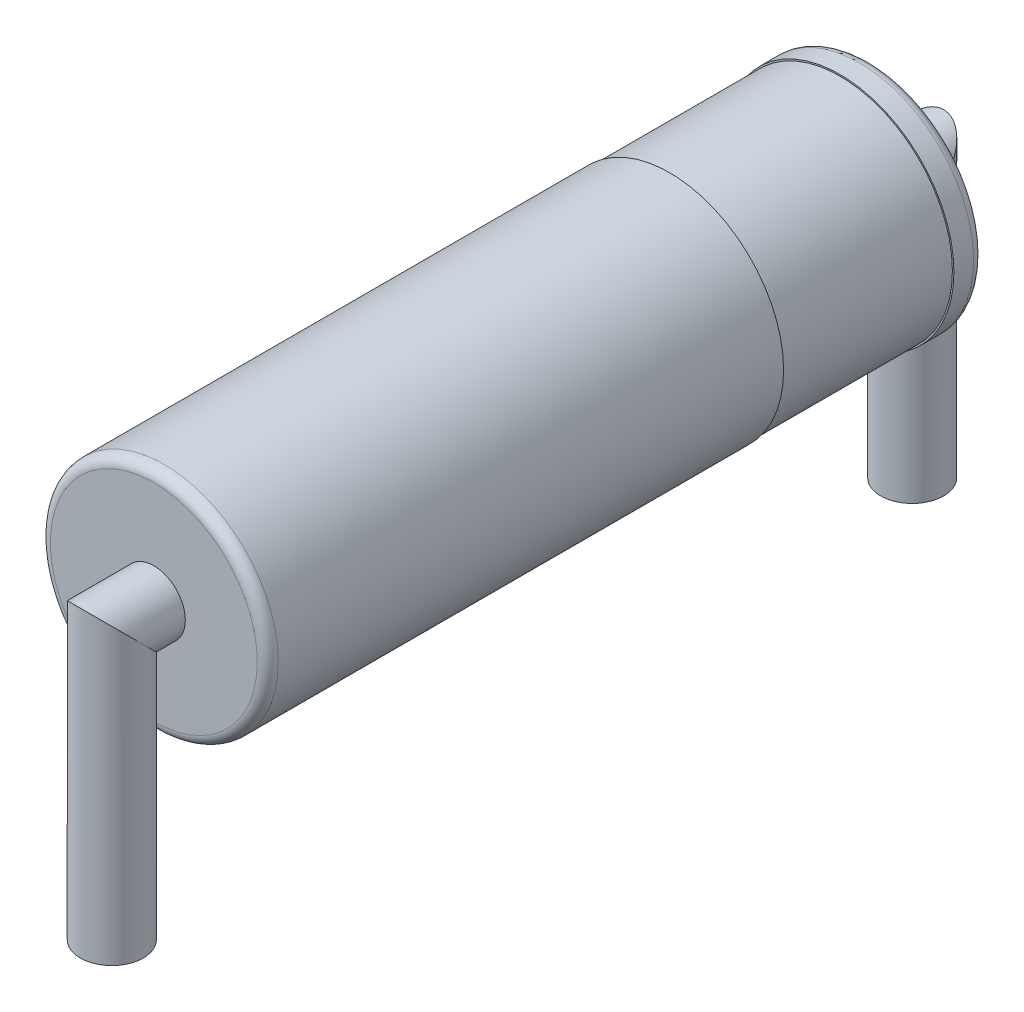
ISO-10303-21;
HEADER;
FILE_DESCRIPTION(('STEP AP214'),'2;1');
FILE_NAME('part.step','',(''),(''),'','','');
FILE_SCHEMA(('AUTOMOTIVE_DESIGN { 1 0 10303 214 1 1 1 1 }'));
ENDSEC;
DATA;
#1=APPLICATION_CONTEXT('core data for automotive mechanical design processes');
#2=APPLICATION_PROTOCOL_DEFINITION('international standard','automotive_design',2000,#1);
#3=PRODUCT_CONTEXT('',#1,'mechanical');
#4=PRODUCT('Part','Part','',(#3));
#5=PRODUCT_RELATED_PRODUCT_CATEGORY('part','',(#4));
#6=PRODUCT_DEFINITION_FORMATION('','',#4);
#7=PRODUCT_DEFINITION_CONTEXT('part definition',#1,'design');
#8=PRODUCT_DEFINITION('design','',#6,#7);
#9=PRODUCT_DEFINITION_SHAPE('','',#8);
#10=(LENGTH_UNIT() NAMED_UNIT(*) SI_UNIT(.MILLI.,.METRE.));
#11=(NAMED_UNIT(*) PLANE_ANGLE_UNIT() SI_UNIT($,.RADIAN.));
#12=(NAMED_UNIT(*) SI_UNIT($,.STERADIAN.) SOLID_ANGLE_UNIT());
#13=UNCERTAINTY_MEASURE_WITH_UNIT(LENGTH_MEASURE(1.E-05),#10,'distance_accuracy_value','');
#14=(GEOMETRIC_REPRESENTATION_CONTEXT(3) GLOBAL_UNCERTAINTY_ASSIGNED_CONTEXT((#13)) GLOBAL_UNIT_ASSIGNED_CONTEXT((#10,
#11,#12)) REPRESENTATION_CONTEXT('',''));
#15=CARTESIAN_POINT('',(0.,0.,0.));
#16=DIRECTION('',(0.,0.,1.));
#17=DIRECTION('',(1.,0.,0.));
#18=AXIS2_PLACEMENT_3D('',#15,#16,#17);
#19=CARTESIAN_POINT('',(0.,0.,3.41));
#20=DIRECTION('',(0.,0.,-1.));
#21=DIRECTION('',(-1.,0.,0.));
#22=AXIS2_PLACEMENT_3D('',#19,#20,#21);
#23=CYLINDRICAL_SURFACE('',#22,1.085);
#24=CARTESIAN_POINT('',(0.,0.,-3.31));
#25=DIRECTION('',(0.,0.,1.));
#26=DIRECTION('',(1.,0.,0.));
#27=AXIS2_PLACEMENT_3D('',#24,#25,#26);
#28=CIRCLE('',#27,1.085);
#29=CARTESIAN_POINT('',(1.085,0.,-3.31));
#30=VERTEX_POINT('',#29);
#31=EDGE_CURVE('E76',#30,#30,#28,.T.);
#32=ORIENTED_EDGE('',*,*,#31,.T.);
#33=EDGE_LOOP('',(#32));
#34=FACE_BOUND('',#33,.T.);
#35=CARTESIAN_POINT('',(0.,0.,-3.12192987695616));
#36=DIRECTION('',(0.,0.,1.));
#37=DIRECTION('',(1.,0.,0.));
#38=AXIS2_PLACEMENT_3D('',#35,#36,#37);
#39=CIRCLE('',#38,1.085);
#40=CARTESIAN_POINT('',(1.085,0.,-3.12192987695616));
#41=VERTEX_POINT('',#40);
#42=EDGE_CURVE('E35',#41,#41,#39,.T.);
#43=ORIENTED_EDGE('',*,*,#42,.F.);
#44=EDGE_LOOP('',(#43));
#45=FACE_BOUND('',#44,.T.);
#46=ADVANCED_FACE('F32',(#34,#45),#23,.T.);
#47=CARTESIAN_POINT('',(0.,0.,-3.41));
#48=DIRECTION('',(0.,0.,1.));
#49=DIRECTION('',(1.,0.,0.));
#50=AXIS2_PLACEMENT_3D('',#47,#48,#49);
#51=PLANE('',#50);
#52=CARTESIAN_POINT('',(0.,0.,-3.41));
#53=DIRECTION('',(0.,0.,1.));
#54=DIRECTION('',(1.,0.,0.));
#55=AXIS2_PLACEMENT_3D('',#52,#53,#54);
#56=CIRCLE('',#55,0.985);
#57=CARTESIAN_POINT('',(0.985,0.,-3.41));
#58=VERTEX_POINT('',#57);
#59=EDGE_CURVE('E44',#58,#58,#56,.F.);
#60=ORIENTED_EDGE('',*,*,#59,.T.);
#61=EDGE_LOOP('',(#60));
#62=FACE_BOUND('',#61,.T.);
#63=CARTESIAN_POINT('',(0.,0.,-3.41));
#64=DIRECTION('',(0.,0.,1.));
#65=DIRECTION('',(1.,0.,0.));
#66=AXIS2_PLACEMENT_3D('',#63,#64,#65);
#67=CIRCLE('',#66,0.3);
#68=CARTESIAN_POINT('',(0.3,0.,-3.41));
#69=VERTEX_POINT('',#68);
#70=EDGE_CURVE('E39',#69,#69,#67,.F.);
#71=ORIENTED_EDGE('',*,*,#70,.F.);
#72=EDGE_LOOP('',(#71));
#73=FACE_BOUND('',#72,.T.);
#74=ADVANCED_FACE('F84',(#62,#73),#51,.F.);
#75=CARTESIAN_POINT('',(0.,0.,-3.31));
#76=DIRECTION('',(0.,0.,1.));
#77=DIRECTION('',(1.,0.,0.));
#78=AXIS2_PLACEMENT_3D('',#75,#76,#77);
#79=TOROIDAL_SURFACE('',#78,0.985,0.1);
#80=ORIENTED_EDGE('',*,*,#59,.F.);
#81=EDGE_LOOP('',(#80));
#82=FACE_BOUND('',#81,.T.);
#83=ORIENTED_EDGE('',*,*,#31,.F.);
#84=EDGE_LOOP('',(#83));
#85=FACE_BOUND('',#84,.T.);
#86=ADVANCED_FACE('F87',(#82,#85),#79,.T.);
#87=CARTESIAN_POINT('',(0.,0.,-3.81));
#88=DIRECTION('',(0.,-1.,0.));
#89=DIRECTION('',(0.,0.,-1.));
#90=AXIS2_PLACEMENT_3D('',#87,#88,#89);
#91=CYLINDRICAL_SURFACE('',#90,0.3);
#92=CARTESIAN_POINT('',(0.,0.,-3.81));
#93=DIRECTION('',(0.,-0.707106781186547,-0.707106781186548));
#94=DIRECTION('',(0.,-0.707106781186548,0.707106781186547));
#95=AXIS2_PLACEMENT_3D('',#92,#93,#94);
#96=ELLIPSE('',#95,0.424264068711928,0.3);
#97=CARTESIAN_POINT('',(0.,-0.3,-3.51));
#98=VERTEX_POINT('',#97);
#99=EDGE_CURVE('E67',#98,#98,#96,.T.);
#100=ORIENTED_EDGE('',*,*,#99,.T.);
#101=EDGE_LOOP('',(#100));
#102=FACE_BOUND('',#101,.T.);
#103=CARTESIAN_POINT('',(0.,-2.585,-3.81));
#104=DIRECTION('',(0.,-1.,0.));
#105=DIRECTION('',(0.,0.,-1.));
#106=AXIS2_PLACEMENT_3D('',#103,#104,#105);
#107=CIRCLE('',#106,0.3);
#108=CARTESIAN_POINT('',(0.,-2.585,-4.11));
#109=VERTEX_POINT('',#108);
#110=EDGE_CURVE('E70',#109,#109,#107,.F.);
#111=ORIENTED_EDGE('',*,*,#110,.T.);
#112=EDGE_LOOP('',(#111));
#113=FACE_BOUND('',#112,.T.);
#114=ADVANCED_FACE('F90',(#102,#113),#91,.T.);
#115=CARTESIAN_POINT('',(0.,0.,-4.65852813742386));
#116=DIRECTION('',(0.,0.,1.));
#117=DIRECTION('',(1.,0.,0.));
#118=AXIS2_PLACEMENT_3D('',#115,#116,#117);
#119=CYLINDRICAL_SURFACE('',#118,0.3);
#120=ORIENTED_EDGE('',*,*,#70,.T.);
#121=EDGE_LOOP('',(#120));
#122=FACE_BOUND('',#121,.T.);
#123=ORIENTED_EDGE('',*,*,#99,.F.);
#124=EDGE_LOOP('',(#123));
#125=FACE_BOUND('',#124,.T.);
#126=ADVANCED_FACE('F112',(#122,#125),#119,.T.);
#127=CARTESIAN_POINT('',(0.,-2.585,-3.81));
#128=DIRECTION('',(0.,-1.,0.));
#129=DIRECTION('',(0.,0.,-1.));
#130=AXIS2_PLACEMENT_3D('',#127,#128,#129);
#131=PLANE('',#130);
#132=ORIENTED_EDGE('',*,*,#110,.F.);
#133=EDGE_LOOP('',(#132));
#134=FACE_BOUND('',#133,.T.);
#135=ADVANCED_FACE('F102',(#134),#131,.T.);
#136=CARTESIAN_POINT('',(0.,1.1535467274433,-3.12192987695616));
#137=DIRECTION('',(0.,0.,1.));
#138=DIRECTION('',(1.,0.,0.));
#139=AXIS2_PLACEMENT_3D('',#136,#137,#138);
#140=PLANE('',#139);
#141=CARTESIAN_POINT('',(0.,0.,-3.12192987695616));
#142=DIRECTION('',(0.,0.,1.));
#143=DIRECTION('',(1.,0.,0.));
#144=AXIS2_PLACEMENT_3D('',#141,#142,#143);
#145=CIRCLE('',#144,1.07091797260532);
#146=CARTESIAN_POINT('',(1.07091797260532,0.,-3.12192987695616));
#147=VERTEX_POINT('',#146);
#148=EDGE_CURVE('E49',#147,#147,#145,.T.);
#149=ORIENTED_EDGE('',*,*,#148,.F.);
#150=EDGE_LOOP('',(#149));
#151=FACE_BOUND('',#150,.T.);
#152=ORIENTED_EDGE('',*,*,#42,.T.);
#153=EDGE_LOOP('',(#152));
#154=FACE_BOUND('',#153,.T.);
#155=ADVANCED_FACE('F99',(#151,#154),#140,.T.);
#156=CARTESIAN_POINT('',(0.,1.1535467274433,-1.50082726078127));
#157=DIRECTION('',(0.,0.,-1.));
#158=DIRECTION('',(-1.,0.,0.));
#159=AXIS2_PLACEMENT_3D('',#156,#157,#158);
#160=PLANE('',#159);
#161=CARTESIAN_POINT('',(0.,0.,-1.50082726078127));
#162=DIRECTION('',(0.,0.,1.));
#163=DIRECTION('',(1.,0.,0.));
#164=AXIS2_PLACEMENT_3D('',#161,#162,#163);
#165=CIRCLE('',#164,1.07091797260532);
#166=CARTESIAN_POINT('',(1.07091797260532,0.,-1.50082726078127));
#167=VERTEX_POINT('',#166);
#168=EDGE_CURVE('E55',#167,#167,#165,.T.);
#169=ORIENTED_EDGE('',*,*,#168,.T.);
#170=EDGE_LOOP('',(#169));
#171=FACE_BOUND('',#170,.T.);
#172=CARTESIAN_POINT('',(0.,0.,-1.50082726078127));
#173=DIRECTION('',(0.,0.,-1.));
#174=DIRECTION('',(-1.,0.,0.));
#175=AXIS2_PLACEMENT_3D('',#172,#173,#174);
#176=CIRCLE('',#175,1.085);
#177=CARTESIAN_POINT('',(-1.085,0.,-1.50082726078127));
#178=VERTEX_POINT('',#177);
#179=EDGE_CURVE('E47',#178,#178,#176,.T.);
#180=ORIENTED_EDGE('',*,*,#179,.T.);
#181=EDGE_LOOP('',(#180));
#182=FACE_BOUND('',#181,.T.);
#183=ADVANCED_FACE('F101',(#171,#182),#160,.T.);
#184=CARTESIAN_POINT('',(0.,0.,0.));
#185=DIRECTION('',(0.,0.,1.));
#186=DIRECTION('',(1.,0.,0.));
#187=AXIS2_PLACEMENT_3D('',#184,#185,#186);
#188=CYLINDRICAL_SURFACE('',#187,1.07091797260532);
#189=ORIENTED_EDGE('',*,*,#148,.T.);
#190=EDGE_LOOP('',(#189));
#191=FACE_BOUND('',#190,.T.);
#192=ORIENTED_EDGE('',*,*,#168,.F.);
#193=EDGE_LOOP('',(#192));
#194=FACE_BOUND('',#193,.T.);
#195=ADVANCED_FACE('F109',(#191,#194),#188,.T.);
#196=CARTESIAN_POINT('',(0.,-2.585,3.81));
#197=DIRECTION('',(0.,-1.,0.));
#198=DIRECTION('',(0.,0.,-1.));
#199=AXIS2_PLACEMENT_3D('',#196,#197,#198);
#200=PLANE('',#199);
#201=CARTESIAN_POINT('',(0.,-2.585,3.81));
#202=DIRECTION('',(0.,-1.,0.));
#203=DIRECTION('',(0.,0.,-1.));
#204=AXIS2_PLACEMENT_3D('',#201,#202,#203);
#205=CIRCLE('',#204,0.3);
#206=CARTESIAN_POINT('',(0.,-2.585,3.51));
#207=VERTEX_POINT('',#206);
#208=EDGE_CURVE('E64',#207,#207,#205,.T.);
#209=ORIENTED_EDGE('',*,*,#208,.T.);
#210=EDGE_LOOP('',(#209));
#211=FACE_BOUND('',#210,.T.);
#212=ADVANCED_FACE('F117',(#211),#200,.T.);
#213=CARTESIAN_POINT('',(0.,0.,3.81));
#214=DIRECTION('',(0.,-1.,0.));
#215=DIRECTION('',(0.,0.,-1.));
#216=AXIS2_PLACEMENT_3D('',#213,#214,#215);
#217=CYLINDRICAL_SURFACE('',#216,0.3);
#218=CARTESIAN_POINT('',(0.,0.,3.81));
#219=DIRECTION('',(0.,-0.707106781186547,0.707106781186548));
#220=DIRECTION('',(0.,-0.707106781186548,-0.707106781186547));
#221=AXIS2_PLACEMENT_3D('',#218,#219,#220);
#222=ELLIPSE('',#221,0.424264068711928,0.3);
#223=CARTESIAN_POINT('',(0.,-0.3,3.51));
#224=VERTEX_POINT('',#223);
#225=EDGE_CURVE('E53',#224,#224,#222,.F.);
#226=ORIENTED_EDGE('',*,*,#225,.F.);
#227=EDGE_LOOP('',(#226));
#228=FACE_BOUND('',#227,.T.);
#229=ORIENTED_EDGE('',*,*,#208,.F.);
#230=EDGE_LOOP('',(#229));
#231=FACE_BOUND('',#230,.T.);
#232=ADVANCED_FACE('F120',(#228,#231),#217,.T.);
#233=CARTESIAN_POINT('',(0.,0.,4.65852813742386));
#234=DIRECTION('',(0.,0.,-1.));
#235=DIRECTION('',(-1.,0.,0.));
#236=AXIS2_PLACEMENT_3D('',#233,#234,#235);
#237=CYLINDRICAL_SURFACE('',#236,0.3);
#238=CARTESIAN_POINT('',(0.,0.,3.41));
#239=DIRECTION('',(0.,0.,1.));
#240=DIRECTION('',(1.,0.,0.));
#241=AXIS2_PLACEMENT_3D('',#238,#239,#240);
#242=CIRCLE('',#241,0.3);
#243=CARTESIAN_POINT('',(0.3,0.,3.41));
#244=VERTEX_POINT('',#243);
#245=EDGE_CURVE('E11',#244,#244,#242,.T.);
#246=ORIENTED_EDGE('',*,*,#245,.T.);
#247=EDGE_LOOP('',(#246));
#248=FACE_BOUND('',#247,.T.);
#249=ORIENTED_EDGE('',*,*,#225,.T.);
#250=EDGE_LOOP('',(#249));
#251=FACE_BOUND('',#250,.T.);
#252=ADVANCED_FACE('F122',(#248,#251),#237,.T.);
#253=CARTESIAN_POINT('',(0.,0.,3.41));
#254=DIRECTION('',(0.,0.,1.));
#255=DIRECTION('',(1.,0.,0.));
#256=AXIS2_PLACEMENT_3D('',#253,#254,#255);
#257=PLANE('',#256);
#258=ORIENTED_EDGE('',*,*,#245,.F.);
#259=EDGE_LOOP('',(#258));
#260=FACE_BOUND('',#259,.T.);
#261=CARTESIAN_POINT('',(0.,0.,3.41));
#262=DIRECTION('',(0.,0.,1.));
#263=DIRECTION('',(1.,0.,0.));
#264=AXIS2_PLACEMENT_3D('',#261,#262,#263);
#265=CIRCLE('',#264,0.985);
#266=CARTESIAN_POINT('',(0.985,0.,3.41));
#267=VERTEX_POINT('',#266);
#268=EDGE_CURVE('E73',#267,#267,#265,.T.);
#269=ORIENTED_EDGE('',*,*,#268,.T.);
#270=EDGE_LOOP('',(#269));
#271=FACE_BOUND('',#270,.T.);
#272=ADVANCED_FACE('F125',(#260,#271),#257,.T.);
#273=CARTESIAN_POINT('',(0.,0.,3.31));
#274=DIRECTION('',(0.,0.,1.));
#275=DIRECTION('',(1.,0.,0.));
#276=AXIS2_PLACEMENT_3D('',#273,#274,#275);
#277=TOROIDAL_SURFACE('',#276,0.985,0.1);
#278=CARTESIAN_POINT('',(0.,0.,3.31));
#279=DIRECTION('',(0.,0.,1.));
#280=DIRECTION('',(1.,0.,0.));
#281=AXIS2_PLACEMENT_3D('',#278,#279,#280);
#282=CIRCLE('',#281,1.085);
#283=CARTESIAN_POINT('',(1.085,0.,3.31));
#284=VERTEX_POINT('',#283);
#285=EDGE_CURVE('E79',#284,#284,#282,.F.);
#286=ORIENTED_EDGE('',*,*,#285,.F.);
#287=EDGE_LOOP('',(#286));
#288=FACE_BOUND('',#287,.T.);
#289=ORIENTED_EDGE('',*,*,#268,.F.);
#290=EDGE_LOOP('',(#289));
#291=FACE_BOUND('',#290,.T.);
#292=ADVANCED_FACE('F135',(#288,#291),#277,.T.);
#293=ORIENTED_EDGE('',*,*,#285,.T.);
#294=EDGE_LOOP('',(#293));
#295=FACE_BOUND('',#294,.T.);
#296=ORIENTED_EDGE('',*,*,#179,.F.);
#297=EDGE_LOOP('',(#296));
#298=FACE_BOUND('',#297,.T.);
#299=ADVANCED_FACE('F96',(#295,#298),#23,.T.);
#300=CLOSED_SHELL('',(#46,#74,#86,#114,#126,#135,#155,#183,#195,#212,#232,#252,#272,#292,#299));
#301=MANIFOLD_SOLID_BREP('B2',#300);
#302=ADVANCED_BREP_SHAPE_REPRESENTATION('',(#18,#301),#14);
#303=SHAPE_DEFINITION_REPRESENTATION(#9,#302);
ENDSEC;
END-ISO-10303-21;
